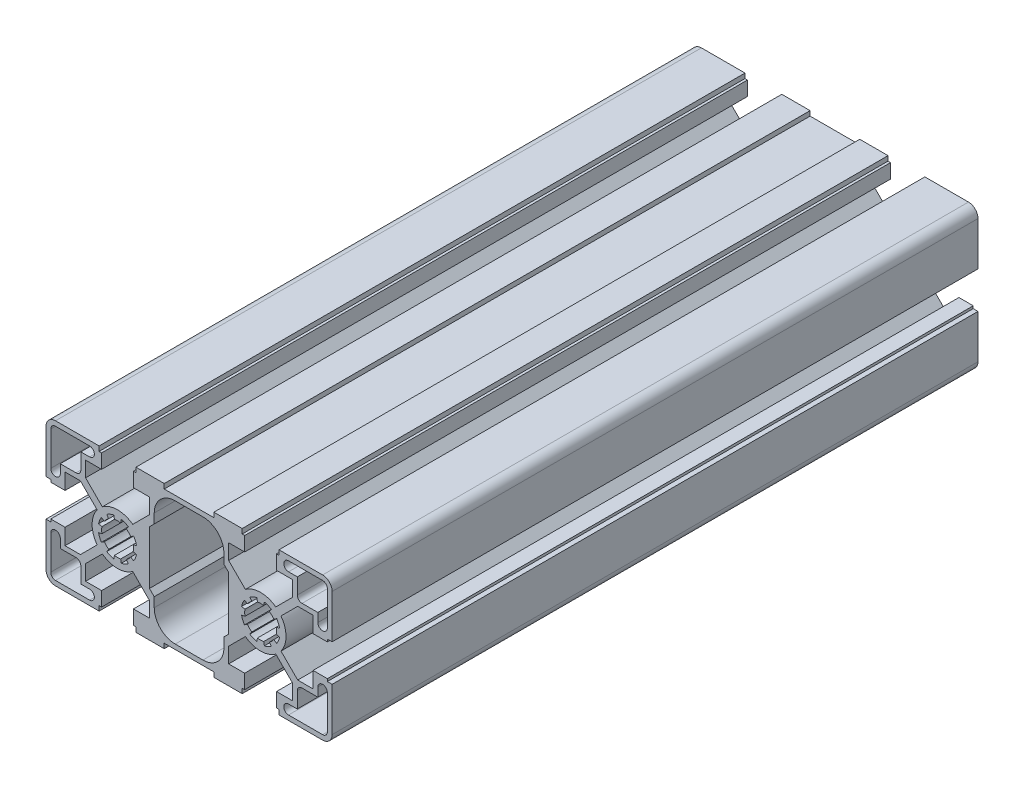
from build123d import *

# Parameters (mm, degrees)
BOSS_EXTRUDE1_DEPTH = 101.6


with BuildPart() as part:
    # Sketch1 → Boss-Extrude1 (new, symmetric)
    with BuildSketch(Plane.XY):
        with BuildLine():
            Line((-42.0116, 22.5044), (-28.2956, 22.5044))
            Line((-28.2956, 22.5044), (-28.2956, 21.0058))
            Line((-28.2956, 21.0058), (-27.5082, 21.0058))
            Line((-27.5082, 21.0058), (-27.5082, 16.51))
            Line((-27.5082, 16.51), (-32.5501, 16.51))
            Line((-32.5501, 16.51), (-32.5501, 11.680106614))
            Line((-32.5501, 11.680106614), (-27.285426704, 6.415433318))
            ThreePointArc((-27.285426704, 6.415433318), (-22.5044, 8.001), (-17.723373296, 6.415433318))
            Line((-17.723373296, 6.415433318), (-12.4587, 11.680106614))
            Line((-12.4587, 11.680106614), (-12.4587, 16.51))
            Line((-12.4587, 16.51), (-17.5006, 16.51))
            Line((-17.5006, 16.51), (-17.5006, 21.0058))
            Line((-17.5006, 21.0058), (-16.7132, 21.0058))
            Line((-16.7132, 21.0058), (-16.7132, 22.5044))
            Line((-16.7132, 22.5044), (-7.8105, 22.5044))
            Line((-7.8105, 22.5044), (-7.8105, 21.0058))
            Line((-7.8105, 21.0058), (7.8105, 21.0058))
            Line((7.8105, 21.0058), (7.8105, 22.5044))
            Line((7.8105, 22.5044), (16.7132, 22.5044))
            Line((16.7132, 22.5044), (16.7132, 21.0058))
            Line((16.7132, 21.0058), (17.5006, 21.0058))
            Line((17.5006, 21.0058), (17.5006, 16.51))
            Line((17.5006, 16.51), (12.4587, 16.51))
            Line((12.4587, 16.51), (12.4587, 11.680106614))
            Line((12.4587, 11.680106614), (17.723373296, 6.415433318))
            ThreePointArc((17.723373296, 6.415433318), (22.5044, 8.001), (27.285426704, 6.415433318))
            Line((27.285426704, 6.415433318), (32.5501, 11.680106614))
            Line((32.5501, 11.680106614), (32.5501, 16.51))
            Line((32.5501, 16.51), (27.5082, 16.51))
            Line((27.5082, 16.51), (27.5082, 21.0058))
            Line((27.5082, 21.0058), (28.2956, 21.0058))
            Line((28.2956, 21.0058), (28.2956, 22.5044))
            Line((28.2956, 22.5044), (42.0116, 22.5044))
            ThreePointArc((42.0116, 22.5044), (44.130940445, 21.626540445), (45.0088, 19.5072))
            Line((45.0088, 19.5072), (45.0088, 5.7912))
            Line((45.0088, 5.7912), (43.5102, 5.7912))
            Line((43.5102, 5.7912), (43.5102, 5.0038))
            Line((43.5102, 5.0038), (39.0144, 5.0038))
            Line((39.0144, 5.0038), (39.0144, 10.0457))
            Line((39.0144, 10.0457), (34.184506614, 10.0457))
            Line((34.184506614, 10.0457), (28.919833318, 4.781026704))
            ThreePointArc((28.919833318, 4.781026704), (30.5054, 0), (28.919833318, -4.781026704))
            Line((28.919833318, -4.781026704), (34.184506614, -10.0457))
            Line((34.184506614, -10.0457), (39.0144, -10.0457))
            Line((39.0144, -10.0457), (39.0144, -5.0038))
            Line((39.0144, -5.0038), (43.5102, -5.0038))
            Line((43.5102, -5.0038), (43.5102, -5.7912))
            Line((43.5102, -5.7912), (45.0088, -5.7912))
            Line((45.0088, -5.7912), (45.0088, -19.5072))
            ThreePointArc((45.0088, -19.5072), (44.130940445, -21.626540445), (42.0116, -22.5044))
            Line((42.0116, -22.5044), (28.2956, -22.5044))
            Line((28.2956, -22.5044), (28.2956, -21.0058))
            Line((28.2956, -21.0058), (27.5082, -21.0058))
            Line((27.5082, -21.0058), (27.5082, -16.51))
            Line((27.5082, -16.51), (32.5501, -16.51))
            Line((32.5501, -16.51), (32.5501, -11.680106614))
            Line((32.5501, -11.680106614), (27.285426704, -6.415433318))
            ThreePointArc((27.285426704, -6.415433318), (22.5044, -8.001), (17.723373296, -6.415433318))
            Line((17.723373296, -6.415433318), (12.4587, -11.680106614))
            Line((12.4587, -11.680106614), (12.4587, -16.51))
            Line((12.4587, -16.51), (17.5006, -16.51))
            Line((17.5006, -16.51), (17.5006, -21.0058))
            Line((17.5006, -21.0058), (16.7132, -21.0058))
            Line((16.7132, -21.0058), (16.7132, -22.5044))
            Line((16.7132, -22.5044), (7.8105, -22.5044))
            Line((7.8105, -22.5044), (7.8105, -21.0058))
            Line((7.8105, -21.0058), (-7.8105, -21.0058))
            Line((-7.8105, -21.0058), (-7.8105, -22.5044))
            Line((-7.8105, -22.5044), (-16.7132, -22.5044))
            Line((-16.7132, -22.5044), (-16.7132, -21.0058))
            Line((-16.7132, -21.0058), (-17.5006, -21.0058))
            Line((-17.5006, -21.0058), (-17.5006, -16.51))
            Line((-17.5006, -16.51), (-12.4587, -16.51))
            Line((-12.4587, -16.51), (-12.4587, -11.680106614))
            Line((-12.4587, -11.680106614), (-17.723373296, -6.415433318))
            ThreePointArc((-17.723373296, -6.415433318), (-22.5044, -8.001), (-27.285426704, -6.415433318))
            Line((-27.285426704, -6.415433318), (-32.5501, -11.680106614))
            Line((-32.5501, -11.680106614), (-32.5501, -16.51))
            Line((-32.5501, -16.51), (-27.5082, -16.51))
            Line((-27.5082, -16.51), (-27.5082, -21.0058))
            Line((-27.5082, -21.0058), (-28.2956, -21.0058))
            Line((-28.2956, -21.0058), (-28.2956, -22.5044))
            Line((-28.2956, -22.5044), (-42.0116, -22.5044))
            ThreePointArc((-42.0116, -22.5044), (-44.130940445, -21.626540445), (-45.0088, -19.5072))
            Line((-45.0088, -19.5072), (-45.0088, -5.7912))
            Line((-45.0088, -5.7912), (-43.5102, -5.7912))
            Line((-43.5102, -5.7912), (-43.5102, -5.0038))
            Line((-43.5102, -5.0038), (-39.0144, -5.0038))
            Line((-39.0144, -5.0038), (-39.0144, -10.0457))
            Line((-39.0144, -10.0457), (-34.184506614, -10.0457))
            Line((-34.184506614, -10.0457), (-28.919833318, -4.781026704))
            ThreePointArc((-28.919833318, -4.781026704), (-30.5054, 0), (-28.919833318, 4.781026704))
            Line((-28.919833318, 4.781026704), (-34.184506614, 10.0457))
            Line((-34.184506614, 10.0457), (-39.0144, 10.0457))
            Line((-39.0144, 10.0457), (-39.0144, 5.0038))
            Line((-39.0144, 5.0038), (-43.5102, 5.0038))
            Line((-43.5102, 5.0038), (-43.5102, 5.7912))
            Line((-43.5102, 5.7912), (-45.0088, 5.7912))
            Line((-45.0088, 5.7912), (-45.0088, 19.5072))
            ThreePointArc((-45.0088, 19.5072), (-44.130940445, 21.626540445), (-42.0116, 22.5044))
        make_face()
        with BuildLine():
            Line((-40.513, 11.5443), (-35.5473, 11.5443))
            ThreePointArc((-35.5473, 11.5443), (-34.487629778, 11.983229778), (-34.0487, 13.0429))
            Line((-34.0487, 13.0429), (-34.0487, 18.0086))
            Line((-34.0487, 18.0086), (-31.2928, 18.0086))
            ThreePointArc((-31.2928, 18.0086), (-29.7942, 19.5072), (-31.2928, 21.0058))
            Line((-31.2928, 21.0058), (-42.0116, 21.0058))
            ThreePointArc((-42.0116, 21.0058), (-43.071270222, 20.566870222), (-43.5102, 19.5072))
            Line((-43.5102, 19.5072), (-43.5102, 8.7884))
            ThreePointArc((-43.5102, 8.7884), (-42.0116, 7.2898), (-40.513, 8.7884))
            Line((-40.513, 8.7884), (-40.513, 11.5443))
        make_face(mode=Mode.SUBTRACT)
        with BuildLine():
            Line((-21.315129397, 5.978867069), (-21.528207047, 4.907653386))
            ThreePointArc((-21.528207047, 4.907653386), (-22.5044, 5.0038), (-23.480592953, 4.907653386))
            Line((-23.480592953, 4.907653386), (-23.693670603, 5.978867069))
            ThreePointArc((-23.693670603, 5.978867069), (-24.837238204, 5.63196963), (-25.89115614, 5.068638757))
            Line((-25.89115614, 5.068638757), (-25.284362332, 4.160507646))
            ThreePointArc((-25.284362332, 4.160507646), (-26.042620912, 3.538220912), (-26.664907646, 2.779962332))
            Line((-26.664907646, 2.779962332), (-27.573038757, 3.38675614))
            ThreePointArc((-27.573038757, 3.38675614), (-28.13636963, 2.332838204), (-28.483267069, 1.189270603))
            Line((-28.483267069, 1.189270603), (-27.412053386, 0.976192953))
            ThreePointArc((-27.412053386, 0.976192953), (-27.5082, 0), (-27.412053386, -0.976192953))
            Line((-27.412053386, -0.976192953), (-28.483267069, -1.189270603))
            ThreePointArc((-28.483267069, -1.189270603), (-28.13636963, -2.332838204), (-27.573038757, -3.38675614))
            Line((-27.573038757, -3.38675614), (-26.664907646, -2.779962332))
            ThreePointArc((-26.664907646, -2.779962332), (-26.042620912, -3.538220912), (-25.284362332, -4.160507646))
            Line((-25.284362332, -4.160507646), (-25.89115614, -5.068638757))
            ThreePointArc((-25.89115614, -5.068638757), (-24.837238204, -5.63196963), (-23.693670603, -5.978867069))
            Line((-23.693670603, -5.978867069), (-23.480592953, -4.907653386))
            ThreePointArc((-23.480592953, -4.907653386), (-22.5044, -5.0038), (-21.528207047, -4.907653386))
            Line((-21.528207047, -4.907653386), (-21.315129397, -5.978867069))
            ThreePointArc((-21.315129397, -5.978867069), (-20.171561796, -5.63196963), (-19.11764386, -5.068638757))
            Line((-19.11764386, -5.068638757), (-19.724437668, -4.160507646))
            ThreePointArc((-19.724437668, -4.160507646), (-18.966179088, -3.538220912), (-18.343892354, -2.779962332))
            Line((-18.343892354, -2.779962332), (-17.435761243, -3.38675614))
            ThreePointArc((-17.435761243, -3.38675614), (-16.87243037, -2.332838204), (-16.525532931, -1.189270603))
            Line((-16.525532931, -1.189270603), (-17.596746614, -0.976192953))
            ThreePointArc((-17.596746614, -0.976192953), (-17.5006, 0), (-17.596746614, 0.976192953))
            Line((-17.596746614, 0.976192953), (-16.525532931, 1.189270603))
            ThreePointArc((-16.525532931, 1.189270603), (-16.87243037, 2.332838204), (-17.435761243, 3.38675614))
            Line((-17.435761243, 3.38675614), (-18.343892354, 2.779962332))
            ThreePointArc((-18.343892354, 2.779962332), (-18.966179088, 3.538220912), (-19.724437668, 4.160507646))
            Line((-19.724437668, 4.160507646), (-19.11764386, 5.068638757))
            ThreePointArc((-19.11764386, 5.068638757), (-20.171561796, 5.63196963), (-21.315129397, 5.978867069))
        make_face(mode=Mode.SUBTRACT)
        with BuildLine():
            Line((-10.9601, 9.909893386), (-12.4587, 8.411293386))
            Line((-12.4587, 8.411293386), (-12.4587, -8.411293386))
            Line((-12.4587, -8.411293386), (-10.9601, -9.909893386))
            Line((-10.9601, -9.909893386), (-10.9601, -12.9032))
            ThreePointArc((-10.9601, -12.9032), (-9.025833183, -17.572933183), (-4.3561, -19.5072))
            Line((-4.3561, -19.5072), (4.3561, -19.5072))
            ThreePointArc((4.3561, -19.5072), (9.025833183, -17.572933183), (10.9601, -12.9032))
            Line((10.9601, -12.9032), (10.9601, -9.909893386))
            Line((10.9601, -9.909893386), (12.4587, -8.411293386))
            Line((12.4587, -8.411293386), (12.4587, 8.411293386))
            Line((12.4587, 8.411293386), (10.9601, 9.909893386))
            Line((10.9601, 9.909893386), (10.9601, 12.9032))
            ThreePointArc((10.9601, 12.9032), (9.025833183, 17.572933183), (4.3561, 19.5072))
            Line((4.3561, 19.5072), (-4.3561, 19.5072))
            ThreePointArc((-4.3561, 19.5072), (-9.025833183, 17.572933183), (-10.9601, 12.9032))
            Line((-10.9601, 12.9032), (-10.9601, 9.909893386))
        make_face(mode=Mode.SUBTRACT)
        with BuildLine():
            Line((-40.513, -11.5443), (-35.5473, -11.5443))
            ThreePointArc((-35.5473, -11.5443), (-34.487629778, -11.983229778), (-34.0487, -13.0429))
            Line((-34.0487, -13.0429), (-34.0487, -18.0086))
            Line((-34.0487, -18.0086), (-31.2928, -18.0086))
            ThreePointArc((-31.2928, -18.0086), (-29.7942, -19.5072), (-31.2928, -21.0058))
            Line((-31.2928, -21.0058), (-42.0116, -21.0058))
            ThreePointArc((-42.0116, -21.0058), (-43.071270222, -20.566870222), (-43.5102, -19.5072))
            Line((-43.5102, -19.5072), (-43.5102, -8.7884))
            ThreePointArc((-43.5102, -8.7884), (-42.0116, -7.2898), (-40.513, -8.7884))
            Line((-40.513, -8.7884), (-40.513, -11.5443))
        make_face(mode=Mode.SUBTRACT)
        with BuildLine():
            Line((42.0116, 21.0058), (31.2928, 21.0058))
            ThreePointArc((31.2928, 21.0058), (29.7942, 19.5072), (31.2928, 18.0086))
            Line((31.2928, 18.0086), (34.0487, 18.0086))
            Line((34.0487, 18.0086), (34.0487, 13.0429))
            ThreePointArc((34.0487, 13.0429), (34.487629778, 11.983229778), (35.5473, 11.5443))
            Line((35.5473, 11.5443), (40.513, 11.5443))
            Line((40.513, 11.5443), (40.513, 8.7884))
            ThreePointArc((40.513, 8.7884), (42.0116, 7.2898), (43.5102, 8.7884))
            Line((43.5102, 8.7884), (43.5102, 19.5072))
            ThreePointArc((43.5102, 19.5072), (43.071270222, 20.566870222), (42.0116, 21.0058))
        make_face(mode=Mode.SUBTRACT)
        with BuildLine():
            Line((40.513, -11.5443), (35.5473, -11.5443))
            ThreePointArc((35.5473, -11.5443), (34.487629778, -11.983229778), (34.0487, -13.0429))
            Line((34.0487, -13.0429), (34.0487, -18.0086))
            Line((34.0487, -18.0086), (31.2928, -18.0086))
            ThreePointArc((31.2928, -18.0086), (29.7942, -19.5072), (31.2928, -21.0058))
            Line((31.2928, -21.0058), (42.0116, -21.0058))
            ThreePointArc((42.0116, -21.0058), (43.071270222, -20.566870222), (43.5102, -19.5072))
            Line((43.5102, -19.5072), (43.5102, -8.7884))
            ThreePointArc((43.5102, -8.7884), (42.0116, -7.2898), (40.513, -8.7884))
            Line((40.513, -8.7884), (40.513, -11.5443))
        make_face(mode=Mode.SUBTRACT)
        with BuildLine():
            Line((27.573038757, 3.38675614), (26.664907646, 2.779962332))
            ThreePointArc((26.664907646, 2.779962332), (26.042620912, 3.538220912), (25.284362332, 4.160507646))
            Line((25.284362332, 4.160507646), (25.89115614, 5.068638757))
            ThreePointArc((25.89115614, 5.068638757), (24.837238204, 5.63196963), (23.693670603, 5.978867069))
            Line((23.693670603, 5.978867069), (23.480592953, 4.907653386))
            ThreePointArc((23.480592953, 4.907653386), (22.5044, 5.0038), (21.528207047, 4.907653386))
            Line((21.528207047, 4.907653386), (21.315129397, 5.978867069))
            ThreePointArc((21.315129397, 5.978867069), (20.171561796, 5.63196963), (19.11764386, 5.068638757))
            Line((19.11764386, 5.068638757), (19.724437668, 4.160507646))
            ThreePointArc((19.724437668, 4.160507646), (18.966179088, 3.538220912), (18.343892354, 2.779962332))
            Line((18.343892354, 2.779962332), (17.435761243, 3.38675614))
            ThreePointArc((17.435761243, 3.38675614), (16.87243037, 2.332838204), (16.525532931, 1.189270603))
            Line((16.525532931, 1.189270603), (17.596746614, 0.976192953))
            ThreePointArc((17.596746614, 0.976192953), (17.5006, 0), (17.596746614, -0.976192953))
            Line((17.596746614, -0.976192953), (16.525532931, -1.189270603))
            ThreePointArc((16.525532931, -1.189270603), (16.87243037, -2.332838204), (17.435761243, -3.38675614))
            Line((17.435761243, -3.38675614), (18.343892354, -2.779962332))
            ThreePointArc((18.343892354, -2.779962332), (18.966179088, -3.538220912), (19.724437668, -4.160507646))
            Line((19.724437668, -4.160507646), (19.11764386, -5.068638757))
            ThreePointArc((19.11764386, -5.068638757), (20.171561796, -5.63196963), (21.315129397, -5.978867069))
            Line((21.315129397, -5.978867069), (21.528207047, -4.907653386))
            ThreePointArc((21.528207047, -4.907653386), (22.5044, -5.0038), (23.480592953, -4.907653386))
            Line((23.480592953, -4.907653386), (23.693670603, -5.978867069))
            ThreePointArc((23.693670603, -5.978867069), (24.837238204, -5.63196963), (25.89115614, -5.068638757))
            Line((25.89115614, -5.068638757), (25.284362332, -4.160507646))
            ThreePointArc((25.284362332, -4.160507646), (26.042620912, -3.538220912), (26.664907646, -2.779962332))
            Line((26.664907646, -2.779962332), (27.573038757, -3.38675614))
            ThreePointArc((27.573038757, -3.38675614), (28.13636963, -2.332838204), (28.483267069, -1.189270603))
            Line((28.483267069, -1.189270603), (27.412053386, -0.976192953))
            ThreePointArc((27.412053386, -0.976192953), (27.5082, 0), (27.412053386, 0.976192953))
            Line((27.412053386, 0.976192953), (28.483267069, 1.189270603))
            ThreePointArc((28.483267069, 1.189270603), (28.13636963, 2.332838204), (27.573038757, 3.38675614))
        make_face(mode=Mode.SUBTRACT)
    extrude(amount=BOSS_EXTRUDE1_DEPTH, both=True)


solid = part.part
